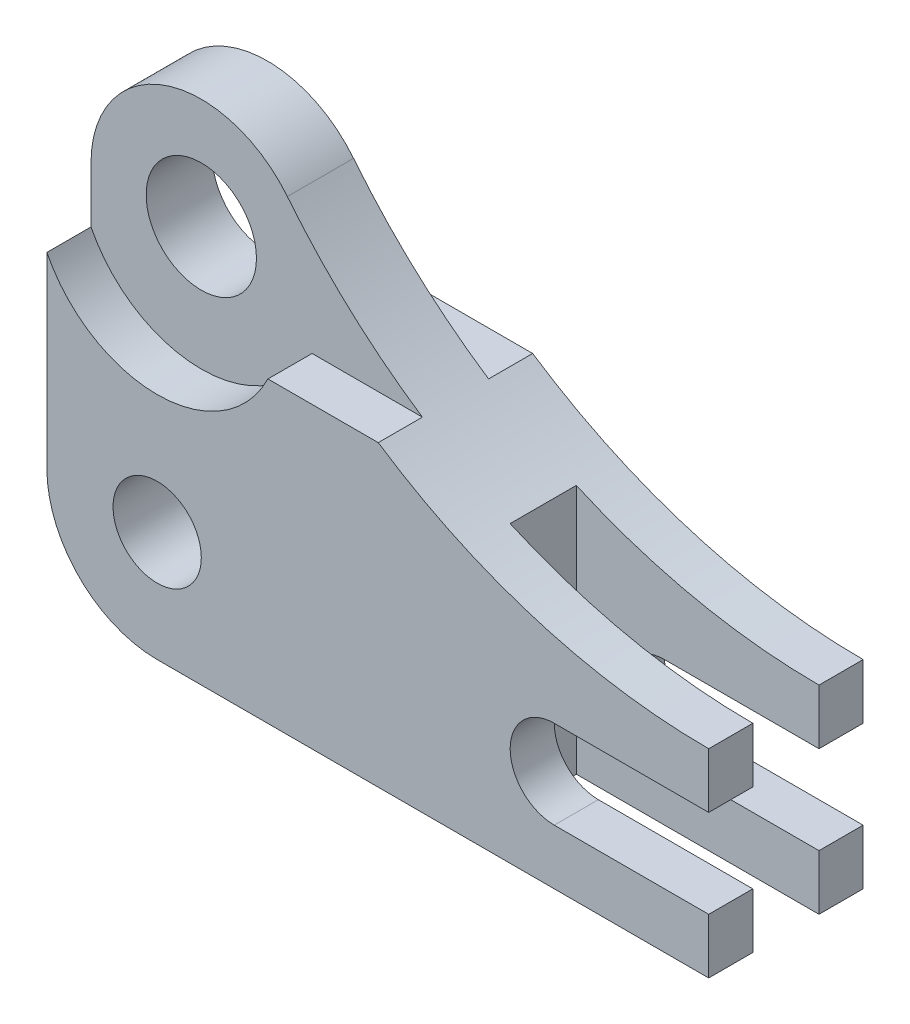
ISO-10303-21;
HEADER;
FILE_DESCRIPTION(('STEP AP214'),'2;1');
FILE_NAME('part.step','',(''),(''),'','','');
FILE_SCHEMA(('AUTOMOTIVE_DESIGN { 1 0 10303 214 1 1 1 1 }'));
ENDSEC;
DATA;
#1=APPLICATION_CONTEXT('core data for automotive mechanical design processes');
#2=APPLICATION_PROTOCOL_DEFINITION('international standard','automotive_design',2000,#1);
#3=PRODUCT_CONTEXT('',#1,'mechanical');
#4=PRODUCT('Part','Part','',(#3));
#5=PRODUCT_RELATED_PRODUCT_CATEGORY('part','',(#4));
#6=PRODUCT_DEFINITION_FORMATION('','',#4);
#7=PRODUCT_DEFINITION_CONTEXT('part definition',#1,'design');
#8=PRODUCT_DEFINITION('design','',#6,#7);
#9=PRODUCT_DEFINITION_SHAPE('','',#8);
#10=(LENGTH_UNIT() NAMED_UNIT(*) SI_UNIT(.MILLI.,.METRE.));
#11=(NAMED_UNIT(*) PLANE_ANGLE_UNIT() SI_UNIT($,.RADIAN.));
#12=(NAMED_UNIT(*) SI_UNIT($,.STERADIAN.) SOLID_ANGLE_UNIT());
#13=UNCERTAINTY_MEASURE_WITH_UNIT(LENGTH_MEASURE(1.E-05),#10,'distance_accuracy_value','');
#14=(GEOMETRIC_REPRESENTATION_CONTEXT(3) GLOBAL_UNCERTAINTY_ASSIGNED_CONTEXT((#13)) GLOBAL_UNIT_ASSIGNED_CONTEXT((#10,
#11,#12)) REPRESENTATION_CONTEXT('',''));
#15=CARTESIAN_POINT('',(0.,0.,0.));
#16=DIRECTION('',(0.,0.,1.));
#17=DIRECTION('',(1.,0.,0.));
#18=AXIS2_PLACEMENT_3D('',#15,#16,#17);
#19=CARTESIAN_POINT('',(150.,180.208333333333,17.5));
#20=DIRECTION('',(0.,0.,-1.));
#21=DIRECTION('',(-1.,0.,0.));
#22=AXIS2_PLACEMENT_3D('',#19,#20,#21);
#23=CYLINDRICAL_SURFACE('',#22,135.208333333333);
#24=CARTESIAN_POINT('',(150.,180.208333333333,-7.5));
#25=DIRECTION('',(0.,0.,1.));
#26=DIRECTION('',(1.,0.,0.));
#27=AXIS2_PLACEMENT_3D('',#24,#25,#26);
#28=CIRCLE('',#27,135.208333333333);
#29=CARTESIAN_POINT('',(150.,45.,-7.5));
#30=VERTEX_POINT('',#29);
#31=CARTESIAN_POINT('',(95.,56.6919643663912,-7.49999999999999));
#32=VERTEX_POINT('',#31);
#33=EDGE_CURVE('E205',#30,#32,#28,.F.);
#34=ORIENTED_EDGE('',*,*,#33,.F.);
#35=DIRECTION('',(0.,0.,-1.));
#36=VECTOR('',#35,1.);
#37=CARTESIAN_POINT('',(150.,45.,17.5));
#38=LINE('',#37,#36);
#39=CARTESIAN_POINT('',(150.,45.,-17.5));
#40=VERTEX_POINT('',#39);
#41=EDGE_CURVE('E335',#30,#40,#38,.T.);
#42=ORIENTED_EDGE('',*,*,#41,.T.);
#43=CARTESIAN_POINT('',(150.,180.208333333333,-17.5));
#44=DIRECTION('',(0.,0.,-1.));
#45=DIRECTION('',(-1.,0.,0.));
#46=AXIS2_PLACEMENT_3D('',#43,#44,#45);
#47=CIRCLE('',#46,135.208333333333);
#48=CARTESIAN_POINT('',(75.1065623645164,67.6371718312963,-17.5));
#49=VERTEX_POINT('',#48);
#50=EDGE_CURVE('E310',#40,#49,#47,.T.);
#51=ORIENTED_EDGE('',*,*,#50,.T.);
#52=DIRECTION('',(0.,0.,-1.));
#53=VECTOR('',#52,1.);
#54=CARTESIAN_POINT('',(75.1065623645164,67.6371718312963,-7.5));
#55=LINE('',#54,#53);
#56=CARTESIAN_POINT('',(75.1065623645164,67.6371718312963,-7.5));
#57=VERTEX_POINT('',#56);
#58=EDGE_CURVE('E255',#57,#49,#55,.T.);
#59=ORIENTED_EDGE('',*,*,#58,.F.);
#60=CARTESIAN_POINT('',(150.,180.208333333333,-7.5));
#61=DIRECTION('',(0.,0.,-1.));
#62=DIRECTION('',(1.,0.,0.));
#63=AXIS2_PLACEMENT_3D('',#60,#61,#62);
#64=CIRCLE('',#63,135.208333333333);
#65=CARTESIAN_POINT('',(44.5058517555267,95.6371911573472,-7.5));
#66=VERTEX_POINT('',#65);
#67=EDGE_CURVE('E246',#57,#66,#64,.T.);
#68=ORIENTED_EDGE('',*,*,#67,.T.);
#69=DIRECTION('',(0.,0.,-1.));
#70=VECTOR('',#69,1.);
#71=CARTESIAN_POINT('',(44.5058517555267,95.6371911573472,17.5));
#72=LINE('',#71,#70);
#73=CARTESIAN_POINT('',(44.5058517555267,95.6371911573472,7.5));
#74=VERTEX_POINT('',#73);
#75=EDGE_CURVE('E332',#74,#66,#72,.T.);
#76=ORIENTED_EDGE('',*,*,#75,.F.);
#77=CARTESIAN_POINT('',(150.,180.208333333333,7.5));
#78=DIRECTION('',(0.,0.,-1.));
#79=DIRECTION('',(1.,0.,0.));
#80=AXIS2_PLACEMENT_3D('',#77,#78,#79);
#81=CIRCLE('',#80,135.208333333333);
#82=CARTESIAN_POINT('',(75.1065623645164,67.6371718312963,7.5));
#83=VERTEX_POINT('',#82);
#84=EDGE_CURVE('E268',#83,#74,#81,.T.);
#85=ORIENTED_EDGE('',*,*,#84,.F.);
#86=DIRECTION('',(0.,0.,1.));
#87=VECTOR('',#86,1.);
#88=CARTESIAN_POINT('',(75.1065623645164,67.6371718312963,7.5));
#89=LINE('',#88,#87);
#90=CARTESIAN_POINT('',(75.1065623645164,67.6371718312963,17.5));
#91=VERTEX_POINT('',#90);
#92=EDGE_CURVE('E279',#83,#91,#89,.T.);
#93=ORIENTED_EDGE('',*,*,#92,.T.);
#94=CARTESIAN_POINT('',(150.,180.208333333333,17.5));
#95=DIRECTION('',(0.,0.,-1.));
#96=DIRECTION('',(-1.,0.,0.));
#97=AXIS2_PLACEMENT_3D('',#94,#95,#96);
#98=CIRCLE('',#97,135.208333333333);
#99=CARTESIAN_POINT('',(150.,45.,17.5));
#100=VERTEX_POINT('',#99);
#101=EDGE_CURVE('E329',#100,#91,#98,.T.);
#102=ORIENTED_EDGE('',*,*,#101,.F.);
#103=CARTESIAN_POINT('',(150.,45.,7.5));
#104=VERTEX_POINT('',#103);
#105=EDGE_CURVE('E215',#100,#104,#38,.T.);
#106=ORIENTED_EDGE('',*,*,#105,.T.);
#107=CARTESIAN_POINT('',(150.,180.208333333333,7.5));
#108=DIRECTION('',(0.,0.,-1.));
#109=DIRECTION('',(-1.,0.,0.));
#110=AXIS2_PLACEMENT_3D('',#107,#108,#109);
#111=CIRCLE('',#110,135.208333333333);
#112=CARTESIAN_POINT('',(95.,56.6919643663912,7.50000000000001));
#113=VERTEX_POINT('',#112);
#114=EDGE_CURVE('E48',#113,#104,#111,.F.);
#115=ORIENTED_EDGE('',*,*,#114,.F.);
#116=DIRECTION('',(0.,0.,-1.));
#117=VECTOR('',#116,1.);
#118=CARTESIAN_POINT('',(95.,56.6919643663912,17.5));
#119=LINE('',#118,#117);
#120=EDGE_CURVE('E196',#32,#113,#119,.F.);
#121=ORIENTED_EDGE('',*,*,#120,.F.);
#122=EDGE_LOOP('',(#34,#42,#51,#59,#68,#76,#85,#93,#102,#106,#115,#121));
#123=FACE_BOUND('',#122,.T.);
#124=ADVANCED_FACE('F33',(#123),#23,.F.);
#125=CARTESIAN_POINT('',(150.,0.,17.5));
#126=DIRECTION('',(0.,1.,0.));
#127=DIRECTION('',(-1.,0.,0.));
#128=AXIS2_PLACEMENT_3D('',#125,#126,#127);
#129=PLANE('',#128);
#130=DIRECTION('',(1.,0.,0.));
#131=VECTOR('',#130,1.);
#132=CARTESIAN_POINT('',(150.,0.,-7.5));
#133=LINE('',#132,#131);
#134=CARTESIAN_POINT('',(95.,0.,-7.49999999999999));
#135=VERTEX_POINT('',#134);
#136=CARTESIAN_POINT('',(150.,0.,-7.5));
#137=VERTEX_POINT('',#136);
#138=EDGE_CURVE('E227',#135,#137,#133,.T.);
#139=ORIENTED_EDGE('',*,*,#138,.F.);
#140=DIRECTION('',(0.,0.,-1.));
#141=VECTOR('',#140,1.);
#142=CARTESIAN_POINT('',(95.,0.,17.5));
#143=LINE('',#142,#141);
#144=CARTESIAN_POINT('',(95.,0.,7.50000000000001));
#145=VERTEX_POINT('',#144);
#146=EDGE_CURVE('E11',#145,#135,#143,.T.);
#147=ORIENTED_EDGE('',*,*,#146,.F.);
#148=DIRECTION('',(-1.,0.,0.));
#149=VECTOR('',#148,1.);
#150=CARTESIAN_POINT('',(150.,0.,7.5));
#151=LINE('',#150,#149);
#152=CARTESIAN_POINT('',(150.,0.,7.5));
#153=VERTEX_POINT('',#152);
#154=EDGE_CURVE('E209',#153,#145,#151,.T.);
#155=ORIENTED_EDGE('',*,*,#154,.F.);
#156=DIRECTION('',(0.,0.,-1.));
#157=VECTOR('',#156,1.);
#158=CARTESIAN_POINT('',(150.,0.,17.5));
#159=LINE('',#158,#157);
#160=CARTESIAN_POINT('',(150.,0.,17.5));
#161=VERTEX_POINT('',#160);
#162=EDGE_CURVE('E354',#161,#153,#159,.T.);
#163=ORIENTED_EDGE('',*,*,#162,.F.);
#164=DIRECTION('',(1.,0.,0.));
#165=VECTOR('',#164,1.);
#166=CARTESIAN_POINT('',(150.,0.,17.5));
#167=LINE('',#166,#165);
#168=CARTESIAN_POINT('',(25.,0.,17.5));
#169=VERTEX_POINT('',#168);
#170=EDGE_CURVE('E317',#169,#161,#167,.T.);
#171=ORIENTED_EDGE('',*,*,#170,.F.);
#172=DIRECTION('',(0.,0.,-1.));
#173=VECTOR('',#172,1.);
#174=CARTESIAN_POINT('',(25.,0.,17.5));
#175=LINE('',#174,#173);
#176=CARTESIAN_POINT('',(25.,0.,-17.5));
#177=VERTEX_POINT('',#176);
#178=EDGE_CURVE('E357',#169,#177,#175,.T.);
#179=ORIENTED_EDGE('',*,*,#178,.T.);
#180=DIRECTION('',(1.,0.,0.));
#181=VECTOR('',#180,1.);
#182=CARTESIAN_POINT('',(150.,0.,-17.5));
#183=LINE('',#182,#181);
#184=CARTESIAN_POINT('',(150.,0.,-17.5));
#185=VERTEX_POINT('',#184);
#186=EDGE_CURVE('E292',#177,#185,#183,.T.);
#187=ORIENTED_EDGE('',*,*,#186,.T.);
#188=EDGE_CURVE('E353',#137,#185,#159,.T.);
#189=ORIENTED_EDGE('',*,*,#188,.F.);
#190=EDGE_LOOP('',(#139,#147,#155,#163,#171,#179,#187,#189));
#191=FACE_BOUND('',#190,.T.);
#192=ADVANCED_FACE('F403',(#191),#129,.F.);
#193=CARTESIAN_POINT('',(150.,12.5,17.5));
#194=DIRECTION('',(-1.,0.,0.));
#195=DIRECTION('',(0.,0.,1.));
#196=AXIS2_PLACEMENT_3D('',#193,#194,#195);
#197=PLANE('',#196);
#198=DIRECTION('',(0.,-1.,0.));
#199=VECTOR('',#198,1.);
#200=CARTESIAN_POINT('',(150.,60.,-7.5));
#201=LINE('',#200,#199);
#202=CARTESIAN_POINT('',(150.,12.5,-7.5));
#203=VERTEX_POINT('',#202);
#204=EDGE_CURVE('E491',#203,#137,#201,.T.);
#205=ORIENTED_EDGE('',*,*,#204,.T.);
#206=ORIENTED_EDGE('',*,*,#188,.T.);
#207=DIRECTION('',(0.,1.,0.));
#208=VECTOR('',#207,1.);
#209=CARTESIAN_POINT('',(150.,12.5,-17.5));
#210=LINE('',#209,#208);
#211=CARTESIAN_POINT('',(150.,12.5,-17.5));
#212=VERTEX_POINT('',#211);
#213=EDGE_CURVE('E295',#185,#212,#210,.T.);
#214=ORIENTED_EDGE('',*,*,#213,.T.);
#215=DIRECTION('',(0.,0.,-1.));
#216=VECTOR('',#215,1.);
#217=CARTESIAN_POINT('',(150.,12.5,17.5));
#218=LINE('',#217,#216);
#219=EDGE_CURVE('E349',#203,#212,#218,.T.);
#220=ORIENTED_EDGE('',*,*,#219,.F.);
#221=EDGE_LOOP('',(#205,#206,#214,#220));
#222=FACE_BOUND('',#221,.T.);
#223=ADVANCED_FACE('F408',(#222),#197,.F.);
#224=DIRECTION('',(0.,-1.,0.));
#225=VECTOR('',#224,1.);
#226=CARTESIAN_POINT('',(150.,60.,7.5));
#227=LINE('',#226,#225);
#228=CARTESIAN_POINT('',(150.,12.5,7.5));
#229=VERTEX_POINT('',#228);
#230=EDGE_CURVE('E210',#229,#153,#227,.T.);
#231=ORIENTED_EDGE('',*,*,#230,.F.);
#232=CARTESIAN_POINT('',(150.,12.5,17.5));
#233=VERTEX_POINT('',#232);
#234=EDGE_CURVE('E350',#233,#229,#218,.T.);
#235=ORIENTED_EDGE('',*,*,#234,.F.);
#236=DIRECTION('',(0.,1.,0.));
#237=VECTOR('',#236,1.);
#238=CARTESIAN_POINT('',(150.,12.5,17.5));
#239=LINE('',#238,#237);
#240=EDGE_CURVE('E319',#161,#233,#239,.T.);
#241=ORIENTED_EDGE('',*,*,#240,.F.);
#242=ORIENTED_EDGE('',*,*,#162,.T.);
#243=EDGE_LOOP('',(#231,#235,#241,#242));
#244=FACE_BOUND('',#243,.T.);
#245=ADVANCED_FACE('F432',(#244),#197,.F.);
#246=CARTESIAN_POINT('',(150.,12.5,17.5));
#247=DIRECTION('',(0.,-1.,0.));
#248=DIRECTION('',(1.,0.,0.));
#249=AXIS2_PLACEMENT_3D('',#246,#247,#248);
#250=PLANE('',#249);
#251=DIRECTION('',(-1.,0.,0.));
#252=VECTOR('',#251,1.);
#253=CARTESIAN_POINT('',(150.,12.5,-7.5));
#254=LINE('',#253,#252);
#255=CARTESIAN_POINT('',(115.,12.5,-7.5));
#256=VERTEX_POINT('',#255);
#257=EDGE_CURVE('E225',#203,#256,#254,.T.);
#258=ORIENTED_EDGE('',*,*,#257,.F.);
#259=ORIENTED_EDGE('',*,*,#219,.T.);
#260=DIRECTION('',(-1.,0.,0.));
#261=VECTOR('',#260,1.);
#262=CARTESIAN_POINT('',(150.,12.5,-17.5));
#263=LINE('',#262,#261);
#264=CARTESIAN_POINT('',(115.,12.5,-17.5));
#265=VERTEX_POINT('',#264);
#266=EDGE_CURVE('E298',#212,#265,#263,.T.);
#267=ORIENTED_EDGE('',*,*,#266,.T.);
#268=DIRECTION('',(0.,0.,-1.));
#269=VECTOR('',#268,1.);
#270=CARTESIAN_POINT('',(115.,12.5,17.5));
#271=LINE('',#270,#269);
#272=EDGE_CURVE('E345',#256,#265,#271,.T.);
#273=ORIENTED_EDGE('',*,*,#272,.F.);
#274=EDGE_LOOP('',(#258,#259,#267,#273));
#275=FACE_BOUND('',#274,.T.);
#276=ADVANCED_FACE('F429',(#275),#250,.F.);
#277=DIRECTION('',(1.,0.,0.));
#278=VECTOR('',#277,1.);
#279=CARTESIAN_POINT('',(150.,12.5,7.5));
#280=LINE('',#279,#278);
#281=CARTESIAN_POINT('',(115.,12.5,7.50000000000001));
#282=VERTEX_POINT('',#281);
#283=EDGE_CURVE('E220',#282,#229,#280,.T.);
#284=ORIENTED_EDGE('',*,*,#283,.F.);
#285=CARTESIAN_POINT('',(115.,12.5,17.5));
#286=VERTEX_POINT('',#285);
#287=EDGE_CURVE('E346',#286,#282,#271,.T.);
#288=ORIENTED_EDGE('',*,*,#287,.F.);
#289=DIRECTION('',(-1.,0.,0.));
#290=VECTOR('',#289,1.);
#291=CARTESIAN_POINT('',(150.,12.5,17.5));
#292=LINE('',#291,#290);
#293=EDGE_CURVE('E321',#233,#286,#292,.T.);
#294=ORIENTED_EDGE('',*,*,#293,.F.);
#295=ORIENTED_EDGE('',*,*,#234,.T.);
#296=EDGE_LOOP('',(#284,#288,#294,#295));
#297=FACE_BOUND('',#296,.T.);
#298=ADVANCED_FACE('F427',(#297),#250,.F.);
#299=CARTESIAN_POINT('',(115.,22.5,17.5));
#300=DIRECTION('',(0.,0.,-1.));
#301=DIRECTION('',(-1.,0.,0.));
#302=AXIS2_PLACEMENT_3D('',#299,#300,#301);
#303=CYLINDRICAL_SURFACE('',#302,10.);
#304=CARTESIAN_POINT('',(115.,22.5,-7.5));
#305=DIRECTION('',(0.,0.,1.));
#306=DIRECTION('',(1.,0.,0.));
#307=AXIS2_PLACEMENT_3D('',#304,#305,#306);
#308=CIRCLE('',#307,10.);
#309=CARTESIAN_POINT('',(115.,32.5,-7.5));
#310=VERTEX_POINT('',#309);
#311=EDGE_CURVE('E218',#256,#310,#308,.F.);
#312=ORIENTED_EDGE('',*,*,#311,.F.);
#313=ORIENTED_EDGE('',*,*,#272,.T.);
#314=CARTESIAN_POINT('',(115.,22.5,-17.5));
#315=DIRECTION('',(0.,0.,-1.));
#316=DIRECTION('',(1.,0.,0.));
#317=AXIS2_PLACEMENT_3D('',#314,#315,#316);
#318=CIRCLE('',#317,10.);
#319=CARTESIAN_POINT('',(115.,32.5,-17.5));
#320=VERTEX_POINT('',#319);
#321=EDGE_CURVE('E301',#265,#320,#318,.T.);
#322=ORIENTED_EDGE('',*,*,#321,.T.);
#323=DIRECTION('',(0.,0.,-1.));
#324=VECTOR('',#323,1.);
#325=CARTESIAN_POINT('',(115.,32.5,17.5));
#326=LINE('',#325,#324);
#327=EDGE_CURVE('E341',#310,#320,#326,.T.);
#328=ORIENTED_EDGE('',*,*,#327,.F.);
#329=EDGE_LOOP('',(#312,#313,#322,#328));
#330=FACE_BOUND('',#329,.T.);
#331=ADVANCED_FACE('F424',(#330),#303,.F.);
#332=CARTESIAN_POINT('',(115.,22.5,7.50000000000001));
#333=DIRECTION('',(0.,0.,-1.));
#334=DIRECTION('',(-1.,0.,0.));
#335=AXIS2_PLACEMENT_3D('',#332,#333,#334);
#336=CIRCLE('',#335,10.);
#337=CARTESIAN_POINT('',(115.,32.5,7.5));
#338=VERTEX_POINT('',#337);
#339=EDGE_CURVE('E490',#338,#282,#336,.F.);
#340=ORIENTED_EDGE('',*,*,#339,.F.);
#341=CARTESIAN_POINT('',(115.,32.5,17.5));
#342=VERTEX_POINT('',#341);
#343=EDGE_CURVE('E342',#342,#338,#326,.T.);
#344=ORIENTED_EDGE('',*,*,#343,.F.);
#345=CARTESIAN_POINT('',(115.,22.5,17.5));
#346=DIRECTION('',(0.,0.,-1.));
#347=DIRECTION('',(1.,0.,0.));
#348=AXIS2_PLACEMENT_3D('',#345,#346,#347);
#349=CIRCLE('',#348,10.);
#350=EDGE_CURVE('E323',#286,#342,#349,.T.);
#351=ORIENTED_EDGE('',*,*,#350,.F.);
#352=ORIENTED_EDGE('',*,*,#287,.T.);
#353=EDGE_LOOP('',(#340,#344,#351,#352));
#354=FACE_BOUND('',#353,.T.);
#355=ADVANCED_FACE('F422',(#354),#303,.F.);
#356=CARTESIAN_POINT('',(150.,32.5,17.5));
#357=DIRECTION('',(0.,1.,0.));
#358=DIRECTION('',(-1.,0.,0.));
#359=AXIS2_PLACEMENT_3D('',#356,#357,#358);
#360=PLANE('',#359);
#361=DIRECTION('',(1.,0.,0.));
#362=VECTOR('',#361,1.);
#363=CARTESIAN_POINT('',(150.,32.5,-7.5));
#364=LINE('',#363,#362);
#365=CARTESIAN_POINT('',(150.,32.5,-7.5));
#366=VERTEX_POINT('',#365);
#367=EDGE_CURVE('E216',#310,#366,#364,.T.);
#368=ORIENTED_EDGE('',*,*,#367,.F.);
#369=ORIENTED_EDGE('',*,*,#327,.T.);
#370=DIRECTION('',(1.,0.,0.));
#371=VECTOR('',#370,1.);
#372=CARTESIAN_POINT('',(150.,32.5,-17.5));
#373=LINE('',#372,#371);
#374=CARTESIAN_POINT('',(150.,32.5,-17.5));
#375=VERTEX_POINT('',#374);
#376=EDGE_CURVE('E304',#320,#375,#373,.T.);
#377=ORIENTED_EDGE('',*,*,#376,.T.);
#378=DIRECTION('',(0.,0.,-1.));
#379=VECTOR('',#378,1.);
#380=CARTESIAN_POINT('',(150.,32.5,17.5));
#381=LINE('',#380,#379);
#382=EDGE_CURVE('E337',#366,#375,#381,.T.);
#383=ORIENTED_EDGE('',*,*,#382,.F.);
#384=EDGE_LOOP('',(#368,#369,#377,#383));
#385=FACE_BOUND('',#384,.T.);
#386=ADVANCED_FACE('F419',(#385),#360,.F.);
#387=DIRECTION('',(-1.,0.,0.));
#388=VECTOR('',#387,1.);
#389=CARTESIAN_POINT('',(150.,32.5,7.5));
#390=LINE('',#389,#388);
#391=CARTESIAN_POINT('',(150.,32.5,7.5));
#392=VERTEX_POINT('',#391);
#393=EDGE_CURVE('E486',#392,#338,#390,.T.);
#394=ORIENTED_EDGE('',*,*,#393,.F.);
#395=CARTESIAN_POINT('',(150.,32.5,17.5));
#396=VERTEX_POINT('',#395);
#397=EDGE_CURVE('E338',#396,#392,#381,.T.);
#398=ORIENTED_EDGE('',*,*,#397,.F.);
#399=DIRECTION('',(1.,0.,0.));
#400=VECTOR('',#399,1.);
#401=CARTESIAN_POINT('',(150.,32.5,17.5));
#402=LINE('',#401,#400);
#403=EDGE_CURVE('E325',#342,#396,#402,.T.);
#404=ORIENTED_EDGE('',*,*,#403,.F.);
#405=ORIENTED_EDGE('',*,*,#343,.T.);
#406=EDGE_LOOP('',(#394,#398,#404,#405));
#407=FACE_BOUND('',#406,.T.);
#408=ADVANCED_FACE('F418',(#407),#360,.F.);
#409=CARTESIAN_POINT('',(150.,45.,17.5));
#410=DIRECTION('',(-1.,0.,0.));
#411=DIRECTION('',(0.,0.,1.));
#412=AXIS2_PLACEMENT_3D('',#409,#410,#411);
#413=PLANE('',#412);
#414=DIRECTION('',(0.,1.,0.));
#415=VECTOR('',#414,1.);
#416=CARTESIAN_POINT('',(150.,45.,-7.5));
#417=LINE('',#416,#415);
#418=EDGE_CURVE('E41',#366,#30,#417,.T.);
#419=ORIENTED_EDGE('',*,*,#418,.F.);
#420=ORIENTED_EDGE('',*,*,#382,.T.);
#421=DIRECTION('',(0.,1.,0.));
#422=VECTOR('',#421,1.);
#423=CARTESIAN_POINT('',(150.,45.,-17.5));
#424=LINE('',#423,#422);
#425=EDGE_CURVE('E307',#375,#40,#424,.T.);
#426=ORIENTED_EDGE('',*,*,#425,.T.);
#427=ORIENTED_EDGE('',*,*,#41,.F.);
#428=EDGE_LOOP('',(#419,#420,#426,#427));
#429=FACE_BOUND('',#428,.T.);
#430=ADVANCED_FACE('F376',(#429),#413,.F.);
#431=DIRECTION('',(0.,-1.,0.));
#432=VECTOR('',#431,1.);
#433=CARTESIAN_POINT('',(150.,45.,7.5));
#434=LINE('',#433,#432);
#435=EDGE_CURVE('E366',#104,#392,#434,.T.);
#436=ORIENTED_EDGE('',*,*,#435,.F.);
#437=ORIENTED_EDGE('',*,*,#105,.F.);
#438=DIRECTION('',(0.,1.,0.));
#439=VECTOR('',#438,1.);
#440=CARTESIAN_POINT('',(150.,45.,17.5));
#441=LINE('',#440,#439);
#442=EDGE_CURVE('E327',#396,#100,#441,.T.);
#443=ORIENTED_EDGE('',*,*,#442,.F.);
#444=ORIENTED_EDGE('',*,*,#397,.T.);
#445=EDGE_LOOP('',(#436,#437,#443,#444));
#446=FACE_BOUND('',#445,.T.);
#447=ADVANCED_FACE('F417',(#446),#413,.F.);
#448=CARTESIAN_POINT('',(25.,80.,17.5));
#449=DIRECTION('',(0.,0.,-1.));
#450=DIRECTION('',(-1.,0.,0.));
#451=AXIS2_PLACEMENT_3D('',#448,#449,#450);
#452=CYLINDRICAL_SURFACE('',#451,25.);
#453=CARTESIAN_POINT('',(25.,80.,-7.5));
#454=DIRECTION('',(0.,0.,1.));
#455=DIRECTION('',(1.,0.,0.));
#456=AXIS2_PLACEMENT_3D('',#453,#454,#455);
#457=CIRCLE('',#456,25.);
#458=CARTESIAN_POINT('',(0.,80.,-7.5));
#459=VERTEX_POINT('',#458);
#460=EDGE_CURVE('E56',#66,#459,#457,.T.);
#461=ORIENTED_EDGE('',*,*,#460,.T.);
#462=DIRECTION('',(0.,0.,-1.));
#463=VECTOR('',#462,1.);
#464=CARTESIAN_POINT('',(0.,80.,17.5));
#465=LINE('',#464,#463);
#466=CARTESIAN_POINT('',(0.,80.,7.5));
#467=VERTEX_POINT('',#466);
#468=EDGE_CURVE('E363',#467,#459,#465,.T.);
#469=ORIENTED_EDGE('',*,*,#468,.F.);
#470=CARTESIAN_POINT('',(25.,80.,7.5));
#471=DIRECTION('',(0.,0.,1.));
#472=DIRECTION('',(1.,0.,0.));
#473=AXIS2_PLACEMENT_3D('',#470,#471,#472);
#474=CIRCLE('',#473,25.);
#475=EDGE_CURVE('E270',#74,#467,#474,.T.);
#476=ORIENTED_EDGE('',*,*,#475,.F.);
#477=ORIENTED_EDGE('',*,*,#75,.T.);
#478=EDGE_LOOP('',(#461,#469,#476,#477));
#479=FACE_BOUND('',#478,.T.);
#480=ADVANCED_FACE('F35',(#479),#452,.T.);
#481=CARTESIAN_POINT('',(25.,80.,-17.5));
#482=DIRECTION('',(0.,0.,1.));
#483=DIRECTION('',(1.,0.,0.));
#484=AXIS2_PLACEMENT_3D('',#481,#482,#483);
#485=PLANE('',#484);
#486=CARTESIAN_POINT('',(25.,25.,-17.5));
#487=DIRECTION('',(0.,0.,1.));
#488=DIRECTION('',(1.,0.,0.));
#489=AXIS2_PLACEMENT_3D('',#486,#487,#488);
#490=CIRCLE('',#489,10.);
#491=CARTESIAN_POINT('',(35.,25.,-17.5));
#492=VERTEX_POINT('',#491);
#493=EDGE_CURVE('E278',#492,#492,#490,.T.);
#494=ORIENTED_EDGE('',*,*,#493,.T.);
#495=EDGE_LOOP('',(#494));
#496=FACE_BOUND('',#495,.T.);
#497=CARTESIAN_POINT('',(25.,80.,-17.5));
#498=DIRECTION('',(0.,0.,1.));
#499=DIRECTION('',(1.,0.,0.));
#500=AXIS2_PLACEMENT_3D('',#497,#498,#499);
#501=CIRCLE('',#500,27.98533534);
#502=CARTESIAN_POINT('',(0.,67.4230769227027,-17.5));
#503=VERTEX_POINT('',#502);
#504=CARTESIAN_POINT('',(50.1065623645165,67.6371718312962,-17.5));
#505=VERTEX_POINT('',#504);
#506=EDGE_CURVE('E233',#503,#505,#501,.T.);
#507=ORIENTED_EDGE('',*,*,#506,.T.);
#508=DIRECTION('',(1.,0.,0.));
#509=VECTOR('',#508,1.);
#510=CARTESIAN_POINT('',(50.1065623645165,67.6371718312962,-17.5));
#511=LINE('',#510,#509);
#512=EDGE_CURVE('E236',#505,#49,#511,.T.);
#513=ORIENTED_EDGE('',*,*,#512,.T.);
#514=ORIENTED_EDGE('',*,*,#50,.F.);
#515=ORIENTED_EDGE('',*,*,#425,.F.);
#516=ORIENTED_EDGE('',*,*,#376,.F.);
#517=ORIENTED_EDGE('',*,*,#321,.F.);
#518=ORIENTED_EDGE('',*,*,#266,.F.);
#519=ORIENTED_EDGE('',*,*,#213,.F.);
#520=ORIENTED_EDGE('',*,*,#186,.F.);
#521=CARTESIAN_POINT('',(25.,25.,-17.5));
#522=DIRECTION('',(0.,0.,1.));
#523=DIRECTION('',(1.,0.,0.));
#524=AXIS2_PLACEMENT_3D('',#521,#522,#523);
#525=CIRCLE('',#524,25.);
#526=CARTESIAN_POINT('',(0.,25.,-17.5));
#527=VERTEX_POINT('',#526);
#528=EDGE_CURVE('E290',#527,#177,#525,.T.);
#529=ORIENTED_EDGE('',*,*,#528,.F.);
#530=DIRECTION('',(0.,-1.,0.));
#531=VECTOR('',#530,1.);
#532=CARTESIAN_POINT('',(0.,25.,-17.5));
#533=LINE('',#532,#531);
#534=EDGE_CURVE('E288',#503,#527,#533,.T.);
#535=ORIENTED_EDGE('',*,*,#534,.F.);
#536=EDGE_LOOP('',(#507,#513,#514,#515,#516,#517,#518,#519,#520,#529,#535));
#537=FACE_BOUND('',#536,.T.);
#538=ADVANCED_FACE('F381',(#496,#537),#485,.F.);
#539=CARTESIAN_POINT('',(0.,25.,17.5));
#540=DIRECTION('',(1.,0.,0.));
#541=DIRECTION('',(0.,0.,-1.));
#542=AXIS2_PLACEMENT_3D('',#539,#540,#541);
#543=PLANE('',#542);
#544=DIRECTION('',(0.,0.,-1.));
#545=VECTOR('',#544,1.);
#546=CARTESIAN_POINT('',(0.,67.4230769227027,-7.5));
#547=LINE('',#546,#545);
#548=CARTESIAN_POINT('',(0.,67.4230769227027,-7.5));
#549=VERTEX_POINT('',#548);
#550=EDGE_CURVE('E250',#549,#503,#547,.T.);
#551=ORIENTED_EDGE('',*,*,#550,.T.);
#552=ORIENTED_EDGE('',*,*,#534,.T.);
#553=DIRECTION('',(0.,0.,-1.));
#554=VECTOR('',#553,1.);
#555=CARTESIAN_POINT('',(0.,25.,17.5));
#556=LINE('',#555,#554);
#557=CARTESIAN_POINT('',(0.,25.,17.5));
#558=VERTEX_POINT('',#557);
#559=EDGE_CURVE('E360',#558,#527,#556,.T.);
#560=ORIENTED_EDGE('',*,*,#559,.F.);
#561=DIRECTION('',(0.,-1.,0.));
#562=VECTOR('',#561,1.);
#563=CARTESIAN_POINT('',(0.,25.,17.5));
#564=LINE('',#563,#562);
#565=CARTESIAN_POINT('',(0.,67.4230769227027,17.5));
#566=VERTEX_POINT('',#565);
#567=EDGE_CURVE('E313',#566,#558,#564,.T.);
#568=ORIENTED_EDGE('',*,*,#567,.F.);
#569=DIRECTION('',(0.,0.,1.));
#570=VECTOR('',#569,1.);
#571=CARTESIAN_POINT('',(0.,67.4230769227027,7.5));
#572=LINE('',#571,#570);
#573=CARTESIAN_POINT('',(0.,67.4230769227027,7.5));
#574=VERTEX_POINT('',#573);
#575=EDGE_CURVE('E276',#574,#566,#572,.T.);
#576=ORIENTED_EDGE('',*,*,#575,.F.);
#577=DIRECTION('',(0.,-1.,0.));
#578=VECTOR('',#577,1.);
#579=CARTESIAN_POINT('',(0.,80.,7.5));
#580=LINE('',#579,#578);
#581=EDGE_CURVE('E272',#467,#574,#580,.T.);
#582=ORIENTED_EDGE('',*,*,#581,.F.);
#583=ORIENTED_EDGE('',*,*,#468,.T.);
#584=DIRECTION('',(0.,-1.,0.));
#585=VECTOR('',#584,1.);
#586=CARTESIAN_POINT('',(0.,80.,-7.5));
#587=LINE('',#586,#585);
#588=EDGE_CURVE('E242',#459,#549,#587,.T.);
#589=ORIENTED_EDGE('',*,*,#588,.T.);
#590=EDGE_LOOP('',(#551,#552,#560,#568,#576,#582,#583,#589));
#591=FACE_BOUND('',#590,.T.);
#592=ADVANCED_FACE('F441',(#591),#543,.F.);
#593=CARTESIAN_POINT('',(25.,80.,17.5));
#594=DIRECTION('',(0.,0.,1.));
#595=DIRECTION('',(1.,0.,0.));
#596=AXIS2_PLACEMENT_3D('',#593,#594,#595);
#597=PLANE('',#596);
#598=CARTESIAN_POINT('',(25.,80.,17.5));
#599=DIRECTION('',(0.,0.,1.));
#600=DIRECTION('',(1.,0.,0.));
#601=AXIS2_PLACEMENT_3D('',#598,#599,#600);
#602=CIRCLE('',#601,27.98533534);
#603=CARTESIAN_POINT('',(50.1065623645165,67.6371718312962,17.5));
#604=VERTEX_POINT('',#603);
#605=EDGE_CURVE('E254',#566,#604,#602,.T.);
#606=ORIENTED_EDGE('',*,*,#605,.F.);
#607=ORIENTED_EDGE('',*,*,#567,.T.);
#608=CARTESIAN_POINT('',(25.,25.,17.5));
#609=DIRECTION('',(0.,0.,1.));
#610=DIRECTION('',(1.,0.,0.));
#611=AXIS2_PLACEMENT_3D('',#608,#609,#610);
#612=CIRCLE('',#611,25.);
#613=EDGE_CURVE('E315',#558,#169,#612,.T.);
#614=ORIENTED_EDGE('',*,*,#613,.T.);
#615=ORIENTED_EDGE('',*,*,#170,.T.);
#616=ORIENTED_EDGE('',*,*,#240,.T.);
#617=ORIENTED_EDGE('',*,*,#293,.T.);
#618=ORIENTED_EDGE('',*,*,#350,.T.);
#619=ORIENTED_EDGE('',*,*,#403,.T.);
#620=ORIENTED_EDGE('',*,*,#442,.T.);
#621=ORIENTED_EDGE('',*,*,#101,.T.);
#622=DIRECTION('',(1.,0.,0.));
#623=VECTOR('',#622,1.);
#624=CARTESIAN_POINT('',(50.1065623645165,67.6371718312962,17.5));
#625=LINE('',#624,#623);
#626=EDGE_CURVE('E261',#604,#91,#625,.T.);
#627=ORIENTED_EDGE('',*,*,#626,.F.);
#628=EDGE_LOOP('',(#606,#607,#614,#615,#616,#617,#618,#619,#620,#621,#627));
#629=FACE_BOUND('',#628,.T.);
#630=CARTESIAN_POINT('',(25.,25.,17.5));
#631=DIRECTION('',(0.,0.,1.));
#632=DIRECTION('',(1.,0.,0.));
#633=AXIS2_PLACEMENT_3D('',#630,#631,#632);
#634=CIRCLE('',#633,10.);
#635=CARTESIAN_POINT('',(35.,25.,17.5));
#636=VERTEX_POINT('',#635);
#637=EDGE_CURVE('E285',#636,#636,#634,.T.);
#638=ORIENTED_EDGE('',*,*,#637,.F.);
#639=EDGE_LOOP('',(#638));
#640=FACE_BOUND('',#639,.T.);
#641=ADVANCED_FACE('F413',(#629,#640),#597,.T.);
#642=CARTESIAN_POINT('',(25.,25.,17.5));
#643=DIRECTION('',(0.,0.,-1.));
#644=DIRECTION('',(-1.,0.,0.));
#645=AXIS2_PLACEMENT_3D('',#642,#643,#644);
#646=CYLINDRICAL_SURFACE('',#645,25.);
#647=ORIENTED_EDGE('',*,*,#528,.T.);
#648=ORIENTED_EDGE('',*,*,#178,.F.);
#649=ORIENTED_EDGE('',*,*,#613,.F.);
#650=ORIENTED_EDGE('',*,*,#559,.T.);
#651=EDGE_LOOP('',(#647,#648,#649,#650));
#652=FACE_BOUND('',#651,.T.);
#653=ADVANCED_FACE('F437',(#652),#646,.T.);
#654=CARTESIAN_POINT('',(25.,25.,17.5));
#655=DIRECTION('',(0.,0.,-1.));
#656=DIRECTION('',(-1.,0.,0.));
#657=AXIS2_PLACEMENT_3D('',#654,#655,#656);
#658=CYLINDRICAL_SURFACE('',#657,10.);
#659=ORIENTED_EDGE('',*,*,#637,.T.);
#660=EDGE_LOOP('',(#659));
#661=FACE_BOUND('',#660,.T.);
#662=ORIENTED_EDGE('',*,*,#493,.F.);
#663=EDGE_LOOP('',(#662));
#664=FACE_BOUND('',#663,.T.);
#665=ADVANCED_FACE('F439',(#661,#664),#658,.F.);
#666=CARTESIAN_POINT('',(25.,80.,7.5));
#667=DIRECTION('',(0.,0.,1.));
#668=DIRECTION('',(1.,0.,0.));
#669=AXIS2_PLACEMENT_3D('',#666,#667,#668);
#670=CYLINDRICAL_SURFACE('',#669,27.98533534);
#671=ORIENTED_EDGE('',*,*,#605,.T.);
#672=DIRECTION('',(0.,0.,1.));
#673=VECTOR('',#672,1.);
#674=CARTESIAN_POINT('',(50.1065623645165,67.6371718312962,7.5));
#675=LINE('',#674,#673);
#676=CARTESIAN_POINT('',(50.1065623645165,67.6371718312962,7.5));
#677=VERTEX_POINT('',#676);
#678=EDGE_CURVE('E275',#677,#604,#675,.T.);
#679=ORIENTED_EDGE('',*,*,#678,.F.);
#680=CARTESIAN_POINT('',(25.,80.,7.5));
#681=DIRECTION('',(0.,0.,1.));
#682=DIRECTION('',(1.,0.,0.));
#683=AXIS2_PLACEMENT_3D('',#680,#681,#682);
#684=CIRCLE('',#683,27.98533534);
#685=EDGE_CURVE('E263',#574,#677,#684,.T.);
#686=ORIENTED_EDGE('',*,*,#685,.F.);
#687=ORIENTED_EDGE('',*,*,#575,.T.);
#688=EDGE_LOOP('',(#671,#679,#686,#687));
#689=FACE_BOUND('',#688,.T.);
#690=ADVANCED_FACE('F472',(#689),#670,.F.);
#691=CARTESIAN_POINT('',(50.1065623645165,67.6371718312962,7.5));
#692=DIRECTION('',(0.,-1.,0.));
#693=DIRECTION('',(0.,0.,-1.));
#694=AXIS2_PLACEMENT_3D('',#691,#692,#693);
#695=PLANE('',#694);
#696=ORIENTED_EDGE('',*,*,#626,.T.);
#697=ORIENTED_EDGE('',*,*,#92,.F.);
#698=DIRECTION('',(1.,0.,0.));
#699=VECTOR('',#698,1.);
#700=CARTESIAN_POINT('',(50.1065623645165,67.6371718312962,7.5));
#701=LINE('',#700,#699);
#702=EDGE_CURVE('E266',#677,#83,#701,.T.);
#703=ORIENTED_EDGE('',*,*,#702,.F.);
#704=ORIENTED_EDGE('',*,*,#678,.T.);
#705=EDGE_LOOP('',(#696,#697,#703,#704));
#706=FACE_BOUND('',#705,.T.);
#707=ADVANCED_FACE('F568',(#706),#695,.F.);
#708=CARTESIAN_POINT('',(25.,80.,7.5));
#709=DIRECTION('',(0.,0.,1.));
#710=DIRECTION('',(1.,0.,0.));
#711=AXIS2_PLACEMENT_3D('',#708,#709,#710);
#712=PLANE('',#711);
#713=CARTESIAN_POINT('',(25.,80.,7.5));
#714=DIRECTION('',(0.,0.,1.));
#715=DIRECTION('',(1.,0.,0.));
#716=AXIS2_PLACEMENT_3D('',#713,#714,#715);
#717=CIRCLE('',#716,12.5);
#718=CARTESIAN_POINT('',(37.5,80.,7.5));
#719=VERTEX_POINT('',#718);
#720=EDGE_CURVE('E204',#719,#719,#717,.T.);
#721=ORIENTED_EDGE('',*,*,#720,.F.);
#722=EDGE_LOOP('',(#721));
#723=FACE_BOUND('',#722,.T.);
#724=ORIENTED_EDGE('',*,*,#685,.T.);
#725=ORIENTED_EDGE('',*,*,#702,.T.);
#726=ORIENTED_EDGE('',*,*,#84,.T.);
#727=ORIENTED_EDGE('',*,*,#475,.T.);
#728=ORIENTED_EDGE('',*,*,#581,.T.);
#729=EDGE_LOOP('',(#724,#725,#726,#727,#728));
#730=FACE_BOUND('',#729,.T.);
#731=ADVANCED_FACE('F475',(#723,#730),#712,.T.);
#732=CARTESIAN_POINT('',(25.,80.,-7.5));
#733=DIRECTION('',(0.,0.,-1.));
#734=DIRECTION('',(-1.,0.,0.));
#735=AXIS2_PLACEMENT_3D('',#732,#733,#734);
#736=CYLINDRICAL_SURFACE('',#735,27.98533534);
#737=ORIENTED_EDGE('',*,*,#506,.F.);
#738=ORIENTED_EDGE('',*,*,#550,.F.);
#739=CARTESIAN_POINT('',(25.,80.,-7.5));
#740=DIRECTION('',(0.,0.,1.));
#741=DIRECTION('',(1.,0.,0.));
#742=AXIS2_PLACEMENT_3D('',#739,#740,#741);
#743=CIRCLE('',#742,27.98533534);
#744=CARTESIAN_POINT('',(50.1065623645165,67.6371718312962,-7.5));
#745=VERTEX_POINT('',#744);
#746=EDGE_CURVE('E239',#549,#745,#743,.T.);
#747=ORIENTED_EDGE('',*,*,#746,.T.);
#748=DIRECTION('',(0.,0.,-1.));
#749=VECTOR('',#748,1.);
#750=CARTESIAN_POINT('',(50.1065623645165,67.6371718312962,-7.5));
#751=LINE('',#750,#749);
#752=EDGE_CURVE('E251',#745,#505,#751,.T.);
#753=ORIENTED_EDGE('',*,*,#752,.T.);
#754=EDGE_LOOP('',(#737,#738,#747,#753));
#755=FACE_BOUND('',#754,.T.);
#756=ADVANCED_FACE('F399',(#755),#736,.F.);
#757=CARTESIAN_POINT('',(50.1065623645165,67.6371718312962,-7.5));
#758=DIRECTION('',(0.,1.,0.));
#759=DIRECTION('',(0.,0.,1.));
#760=AXIS2_PLACEMENT_3D('',#757,#758,#759);
#761=PLANE('',#760);
#762=ORIENTED_EDGE('',*,*,#512,.F.);
#763=ORIENTED_EDGE('',*,*,#752,.F.);
#764=DIRECTION('',(1.,0.,0.));
#765=VECTOR('',#764,1.);
#766=CARTESIAN_POINT('',(50.1065623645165,67.6371718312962,-7.5));
#767=LINE('',#766,#765);
#768=EDGE_CURVE('E248',#745,#57,#767,.T.);
#769=ORIENTED_EDGE('',*,*,#768,.T.);
#770=ORIENTED_EDGE('',*,*,#58,.T.);
#771=EDGE_LOOP('',(#762,#763,#769,#770));
#772=FACE_BOUND('',#771,.T.);
#773=ADVANCED_FACE('F385',(#772),#761,.T.);
#774=CARTESIAN_POINT('',(25.,80.,-7.5));
#775=DIRECTION('',(0.,0.,-1.));
#776=DIRECTION('',(1.,0.,0.));
#777=AXIS2_PLACEMENT_3D('',#774,#775,#776);
#778=PLANE('',#777);
#779=CARTESIAN_POINT('',(25.,80.,-7.5));
#780=DIRECTION('',(0.,0.,-1.));
#781=DIRECTION('',(-1.,0.,0.));
#782=AXIS2_PLACEMENT_3D('',#779,#780,#781);
#783=CIRCLE('',#782,12.5);
#784=CARTESIAN_POINT('',(12.5,80.,-7.5));
#785=VERTEX_POINT('',#784);
#786=EDGE_CURVE('E232',#785,#785,#783,.T.);
#787=ORIENTED_EDGE('',*,*,#786,.F.);
#788=EDGE_LOOP('',(#787));
#789=FACE_BOUND('',#788,.T.);
#790=ORIENTED_EDGE('',*,*,#746,.F.);
#791=ORIENTED_EDGE('',*,*,#588,.F.);
#792=ORIENTED_EDGE('',*,*,#460,.F.);
#793=ORIENTED_EDGE('',*,*,#67,.F.);
#794=ORIENTED_EDGE('',*,*,#768,.F.);
#795=EDGE_LOOP('',(#790,#791,#792,#793,#794));
#796=FACE_BOUND('',#795,.T.);
#797=ADVANCED_FACE('F388',(#789,#796),#778,.T.);
#798=CARTESIAN_POINT('',(25.,80.,-17.5));
#799=DIRECTION('',(0.,0.,1.));
#800=DIRECTION('',(1.,0.,0.));
#801=AXIS2_PLACEMENT_3D('',#798,#799,#800);
#802=CYLINDRICAL_SURFACE('',#801,12.5);
#803=ORIENTED_EDGE('',*,*,#786,.T.);
#804=EDGE_LOOP('',(#803));
#805=FACE_BOUND('',#804,.T.);
#806=ORIENTED_EDGE('',*,*,#720,.T.);
#807=EDGE_LOOP('',(#806));
#808=FACE_BOUND('',#807,.T.);
#809=ADVANCED_FACE('F390',(#805,#808),#802,.F.);
#810=CARTESIAN_POINT('',(95.,60.,-7.49999999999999));
#811=DIRECTION('',(1.,0.,0.));
#812=DIRECTION('',(0.,0.,-1.));
#813=AXIS2_PLACEMENT_3D('',#810,#811,#812);
#814=PLANE('',#813);
#815=ORIENTED_EDGE('',*,*,#120,.T.);
#816=DIRECTION('',(0.,-1.,0.));
#817=VECTOR('',#816,1.);
#818=CARTESIAN_POINT('',(95.,60.,7.50000000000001));
#819=LINE('',#818,#817);
#820=EDGE_CURVE('E198',#113,#145,#819,.T.);
#821=ORIENTED_EDGE('',*,*,#820,.T.);
#822=ORIENTED_EDGE('',*,*,#146,.T.);
#823=DIRECTION('',(0.,-1.,0.));
#824=VECTOR('',#823,1.);
#825=CARTESIAN_POINT('',(95.,60.,-7.49999999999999));
#826=LINE('',#825,#824);
#827=EDGE_CURVE('E201',#32,#135,#826,.T.);
#828=ORIENTED_EDGE('',*,*,#827,.F.);
#829=EDGE_LOOP('',(#815,#821,#822,#828));
#830=FACE_BOUND('',#829,.T.);
#831=ADVANCED_FACE('F197',(#830),#814,.T.);
#832=CARTESIAN_POINT('',(150.,60.,-7.5));
#833=DIRECTION('',(0.,0.,1.));
#834=DIRECTION('',(1.,0.,0.));
#835=AXIS2_PLACEMENT_3D('',#832,#833,#834);
#836=PLANE('',#835);
#837=ORIENTED_EDGE('',*,*,#33,.T.);
#838=ORIENTED_EDGE('',*,*,#827,.T.);
#839=ORIENTED_EDGE('',*,*,#138,.T.);
#840=ORIENTED_EDGE('',*,*,#204,.F.);
#841=ORIENTED_EDGE('',*,*,#257,.T.);
#842=ORIENTED_EDGE('',*,*,#311,.T.);
#843=ORIENTED_EDGE('',*,*,#367,.T.);
#844=ORIENTED_EDGE('',*,*,#418,.T.);
#845=EDGE_LOOP('',(#837,#838,#839,#840,#841,#842,#843,#844));
#846=FACE_BOUND('',#845,.T.);
#847=ADVANCED_FACE('F371',(#846),#836,.T.);
#848=CARTESIAN_POINT('',(150.,60.,7.5));
#849=DIRECTION('',(0.,0.,-1.));
#850=DIRECTION('',(-1.,0.,0.));
#851=AXIS2_PLACEMENT_3D('',#848,#849,#850);
#852=PLANE('',#851);
#853=ORIENTED_EDGE('',*,*,#114,.T.);
#854=ORIENTED_EDGE('',*,*,#435,.T.);
#855=ORIENTED_EDGE('',*,*,#393,.T.);
#856=ORIENTED_EDGE('',*,*,#339,.T.);
#857=ORIENTED_EDGE('',*,*,#283,.T.);
#858=ORIENTED_EDGE('',*,*,#230,.T.);
#859=ORIENTED_EDGE('',*,*,#154,.T.);
#860=ORIENTED_EDGE('',*,*,#820,.F.);
#861=EDGE_LOOP('',(#853,#854,#855,#856,#857,#858,#859,#860));
#862=FACE_BOUND('',#861,.T.);
#863=ADVANCED_FACE('F207',(#862),#852,.T.);
#864=CLOSED_SHELL('',(#124,#192,#223,#245,#276,#298,#331,#355,#386,#408,#430,#447,#480,#538,
#592,#641,#653,#665,#690,#707,#731,#756,#773,#797,#809,#831,#847,#863));
#865=MANIFOLD_SOLID_BREP('B2',#864);
#866=ADVANCED_BREP_SHAPE_REPRESENTATION('',(#18,#865),#14);
#867=SHAPE_DEFINITION_REPRESENTATION(#9,#866);
ENDSEC;
END-ISO-10303-21;
